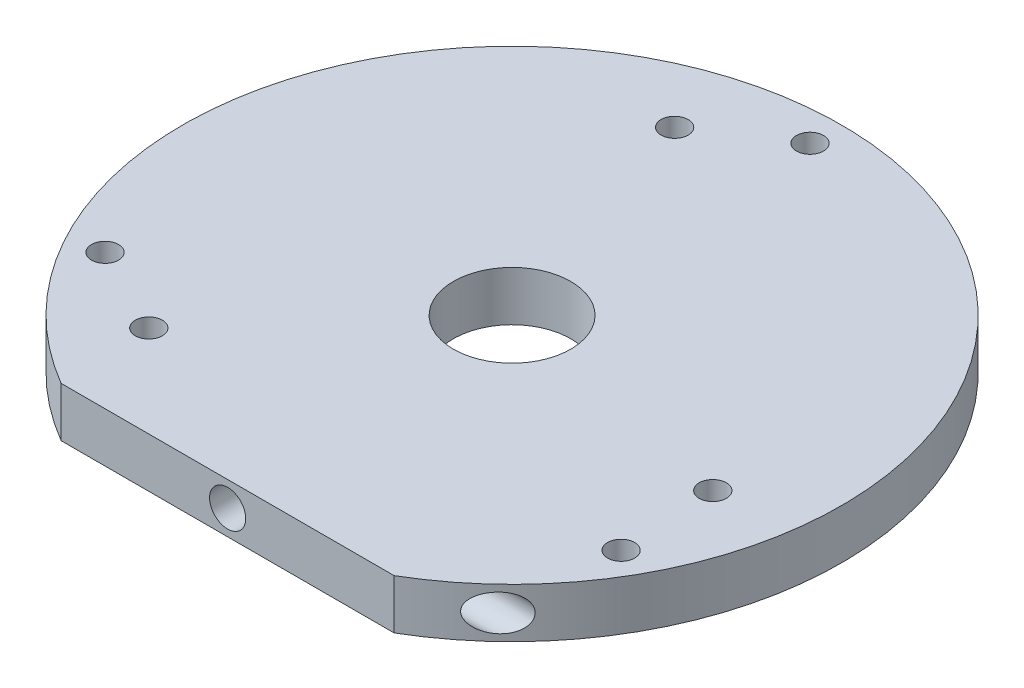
ISO-10303-21;
HEADER;
FILE_DESCRIPTION(('STEP AP214'),'2;1');
FILE_NAME('part.step','',(''),(''),'','','');
FILE_SCHEMA(('AUTOMOTIVE_DESIGN { 1 0 10303 214 1 1 1 1 }'));
ENDSEC;
DATA;
#1=APPLICATION_CONTEXT('core data for automotive mechanical design processes');
#2=APPLICATION_PROTOCOL_DEFINITION('international standard','automotive_design',2000,#1);
#3=PRODUCT_CONTEXT('',#1,'mechanical');
#4=PRODUCT('Part','Part','',(#3));
#5=PRODUCT_RELATED_PRODUCT_CATEGORY('part','',(#4));
#6=PRODUCT_DEFINITION_FORMATION('','',#4);
#7=PRODUCT_DEFINITION_CONTEXT('part definition',#1,'design');
#8=PRODUCT_DEFINITION('design','',#6,#7);
#9=PRODUCT_DEFINITION_SHAPE('','',#8);
#10=(LENGTH_UNIT() NAMED_UNIT(*) SI_UNIT(.MILLI.,.METRE.));
#11=(NAMED_UNIT(*) PLANE_ANGLE_UNIT() SI_UNIT($,.RADIAN.));
#12=(NAMED_UNIT(*) SI_UNIT($,.STERADIAN.) SOLID_ANGLE_UNIT());
#13=UNCERTAINTY_MEASURE_WITH_UNIT(LENGTH_MEASURE(1.E-05),#10,'distance_accuracy_value','');
#14=(GEOMETRIC_REPRESENTATION_CONTEXT(3) GLOBAL_UNCERTAINTY_ASSIGNED_CONTEXT((#13)) GLOBAL_UNIT_ASSIGNED_CONTEXT((#10,
#11,#12)) REPRESENTATION_CONTEXT('',''));
#15=CARTESIAN_POINT('',(0.,0.,0.));
#16=DIRECTION('',(0.,0.,1.));
#17=DIRECTION('',(1.,0.,0.));
#18=AXIS2_PLACEMENT_3D('',#15,#16,#17);
#19=CARTESIAN_POINT('',(36.501,-4.74999999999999,26.5));
#20=DIRECTION('',(-1.,0.,0.));
#21=DIRECTION('',(0.,0.,1.));
#22=AXIS2_PLACEMENT_3D('',#19,#20,#21);
#23=CYLINDRICAL_SURFACE('',#22,2.);
#24=CARTESIAN_POINT('',(22.8035085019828,-4.74999999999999,28.5));
#25=CARTESIAN_POINT('',(22.8035194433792,-4.66614474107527,28.4999917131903));
#26=CARTESIAN_POINT('',(22.8101869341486,-4.58214146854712,28.4946603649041));
#27=CARTESIAN_POINT('',(22.836100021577,-4.41730327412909,28.4738966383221));
#28=CARTESIAN_POINT('',(22.8553814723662,-4.33647808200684,28.4584354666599));
#29=CARTESIAN_POINT('',(22.9042916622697,-4.1812608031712,28.4190848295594));
#30=CARTESIAN_POINT('',(22.9338120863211,-4.10681116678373,28.3952835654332));
#31=CARTESIAN_POINT('',(23.0010219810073,-3.96449597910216,28.3408690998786));
#32=CARTESIAN_POINT('',(23.0387126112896,-3.89663136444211,28.3102549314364));
#33=CARTESIAN_POINT('',(23.1425383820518,-3.73255945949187,28.2255110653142));
#34=CARTESIAN_POINT('',(23.2129906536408,-3.64102699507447,28.1676508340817));
#35=CARTESIAN_POINT('',(23.3634974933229,-3.47316212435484,28.0429420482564));
#36=CARTESIAN_POINT('',(23.443578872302,-3.3968738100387,27.9760683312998));
#37=CARTESIAN_POINT('',(23.5892914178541,-3.27545746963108,27.8532234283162));
#38=CARTESIAN_POINT('',(23.6536059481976,-3.22728716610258,27.798639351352));
#39=CARTESIAN_POINT('',(23.784763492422,-3.13837657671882,27.6865037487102));
#40=CARTESIAN_POINT('',(23.8516077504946,-3.09764000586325,27.6289507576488));
#41=CARTESIAN_POINT('',(24.0548205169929,-2.98595285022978,27.4526435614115));
#42=CARTESIAN_POINT('',(24.1938826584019,-2.92551392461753,27.3302296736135));
#43=CARTESIAN_POINT('',(24.4802446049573,-2.82909849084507,27.0740844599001));
#44=CARTESIAN_POINT('',(24.627655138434,-2.79415684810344,26.9400986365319));
#45=CARTESIAN_POINT('',(24.9223768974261,-2.75228770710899,26.6676836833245));
#46=CARTESIAN_POINT('',(25.0696881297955,-2.74535802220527,26.5292549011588));
#47=CARTESIAN_POINT('',(25.3613275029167,-2.76070477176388,26.2505960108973));
#48=CARTESIAN_POINT('',(25.5056535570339,-2.78300097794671,26.1103647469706));
#49=CARTESIAN_POINT('',(25.7877267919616,-2.85940936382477,25.8318062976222));
#50=CARTESIAN_POINT('',(25.9254811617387,-2.91348587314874,25.6934771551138));
#51=CARTESIAN_POINT('',(26.1515970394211,-3.03641799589,25.462956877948));
#52=CARTESIAN_POINT('',(26.2427926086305,-3.09658550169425,25.3689125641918));
#53=CARTESIAN_POINT('',(26.4167638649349,-3.23641911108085,25.1877003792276));
#54=CARTESIAN_POINT('',(26.4995516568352,-3.31605660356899,25.1005226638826));
#55=CARTESIAN_POINT('',(26.6355340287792,-3.47522142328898,24.9560782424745));
#56=CARTESIAN_POINT('',(26.6911622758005,-3.55059027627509,24.8965356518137));
#57=CARTESIAN_POINT('',(26.7931403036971,-3.71346703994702,24.7867550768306));
#58=CARTESIAN_POINT('',(26.8395013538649,-3.80095998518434,24.7365057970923));
#59=CARTESIAN_POINT('',(26.9134018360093,-3.9708233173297,24.656059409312));
#60=CARTESIAN_POINT('',(26.9428120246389,-4.05144151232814,24.6238951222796));
#61=CARTESIAN_POINT('',(26.9921293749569,-4.21882955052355,24.5698249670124));
#62=CARTESIAN_POINT('',(27.0120416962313,-4.30559602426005,24.5479135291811));
#63=CARTESIAN_POINT('',(27.0412231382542,-4.48350719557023,24.5157651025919));
#64=CARTESIAN_POINT('',(27.0504384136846,-4.57467165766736,24.5055871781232));
#65=CARTESIAN_POINT('',(27.057386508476,-4.75796714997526,24.4979155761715));
#66=CARTESIAN_POINT('',(27.055122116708,-4.85009793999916,24.5004188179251));
#67=CARTESIAN_POINT('',(27.0399634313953,-5.02443145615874,24.5171466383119));
#68=CARTESIAN_POINT('',(27.0279828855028,-5.10681559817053,24.5303636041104));
#69=CARTESIAN_POINT('',(26.9952458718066,-5.26761622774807,24.5663853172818));
#70=CARTESIAN_POINT('',(26.9744886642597,-5.34603238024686,24.5891908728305));
#71=CARTESIAN_POINT('',(26.9241028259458,-5.50074948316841,24.6443529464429));
#72=CARTESIAN_POINT('',(26.8941150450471,-5.57679386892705,24.6770951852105));
#73=CARTESIAN_POINT('',(26.8269802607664,-5.72176054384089,24.7500625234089));
#74=CARTESIAN_POINT('',(26.7898292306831,-5.79067879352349,24.7902918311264));
#75=CARTESIAN_POINT('',(26.6904944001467,-5.95192247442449,24.8972894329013));
#76=CARTESIAN_POINT('',(26.6248128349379,-6.03977326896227,24.9675749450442));
#77=CARTESIAN_POINT('',(26.483957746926,-6.1988282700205,25.116938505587));
#78=CARTESIAN_POINT('',(26.4087637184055,-6.26999553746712,25.1960355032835));
#79=CARTESIAN_POINT('',(26.2230230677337,-6.41932603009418,25.3895022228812));
#80=CARTESIAN_POINT('',(26.1095309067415,-6.49069954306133,25.5062773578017));
#81=CARTESIAN_POINT('',(25.8744931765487,-6.60664263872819,25.7446859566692));
#82=CARTESIAN_POINT('',(25.7529376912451,-6.65117851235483,25.8663253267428));
#83=CARTESIAN_POINT('',(25.4683772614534,-6.72538219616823,26.1469362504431));
#84=CARTESIAN_POINT('',(25.3036716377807,-6.74685849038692,26.3063937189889));
#85=CARTESIAN_POINT('',(25.054260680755,-6.75109382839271,26.5433116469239));
#86=CARTESIAN_POINT('',(24.9706118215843,-6.74781793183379,26.6220157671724));
#87=CARTESIAN_POINT('',(24.8030436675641,-6.73210996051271,26.7782016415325));
#88=CARTESIAN_POINT('',(24.7191245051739,-6.71968184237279,26.8556839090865));
#89=CARTESIAN_POINT('',(24.5506433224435,-6.68556392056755,27.0097965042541));
#90=CARTESIAN_POINT('',(24.4660845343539,-6.66377263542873,27.0864077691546));
#91=CARTESIAN_POINT('',(24.2978650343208,-6.61081415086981,27.2374104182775));
#92=CARTESIAN_POINT('',(24.2142045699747,-6.57964443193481,27.3118012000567));
#93=CARTESIAN_POINT('',(24.0487721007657,-6.50773501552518,27.4575796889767));
#94=CARTESIAN_POINT('',(23.9669959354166,-6.46701918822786,27.5289743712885));
#95=CARTESIAN_POINT('',(23.8061573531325,-6.37551184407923,27.6681797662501));
#96=CARTESIAN_POINT('',(23.7270928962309,-6.32472810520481,27.7359931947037));
#97=CARTESIAN_POINT('',(23.5660096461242,-6.20728499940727,27.8730216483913));
#98=CARTESIAN_POINT('',(23.4843634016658,-6.13960936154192,27.9418154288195));
#99=CARTESIAN_POINT('',(23.3284027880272,-5.99021576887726,28.0721553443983));
#100=CARTESIAN_POINT('',(23.2540791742,-5.90851588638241,28.1337106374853));
#101=CARTESIAN_POINT('',(23.1324306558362,-5.7503510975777,28.2337631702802));
#102=CARTESIAN_POINT('',(23.0828195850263,-5.67696692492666,28.2743134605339));
#103=CARTESIAN_POINT('',(22.9929649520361,-5.52096081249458,28.3474321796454));
#104=CARTESIAN_POINT('',(22.9527095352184,-5.43835076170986,28.3800107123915));
#105=CARTESIAN_POINT('',(22.8923772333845,-5.28403428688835,28.4286867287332));
#106=CARTESIAN_POINT('',(22.8698066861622,-5.21395637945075,28.4468356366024));
#107=CARTESIAN_POINT('',(22.8340060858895,-5.07003923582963,28.4755808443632));
#108=CARTESIAN_POINT('',(22.8207512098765,-4.99621056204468,28.4861972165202));
#109=CARTESIAN_POINT('',(22.8096595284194,-4.89312844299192,28.4950775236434));
#110=CARTESIAN_POINT('',(22.807358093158,-4.86459020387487,28.4969195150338));
#111=CARTESIAN_POINT('',(22.8042805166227,-4.80737377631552,28.4993823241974));
#112=CARTESIAN_POINT('',(22.8035047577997,-4.77869555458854,28.5000028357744));
#113=CARTESIAN_POINT('',(22.8035085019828,-4.74999999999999,28.5));
#114=B_SPLINE_CURVE_WITH_KNOTS('',3,(#24,#25,#26,#27,#28,#29,#30,#31,#32,#33,#34,#35,#36,#37,
#38,#39,#40,#41,#42,#43,#44,#45,#46,#47,#48,#49,#50,#51,#52,#53,#54,#55,#56,#57,#58,#59,#60,#61,
#62,#63,#64,#65,#66,#67,#68,#69,#70,#71,#72,#73,#74,#75,#76,#77,#78,#79,#80,#81,#82,#83,#84,#85,
#86,#87,#88,#89,#90,#91,#92,#93,#94,#95,#96,#97,#98,#99,#100,#101,#102,#103,#104,#105,#106,#107,
#108,#109,#110,#111,#112,#113),.UNSPECIFIED.,.T.,.F.,(4,2,2,2,2,2,2,2,2,2,2,2,2,2,2,2,2,2,2,2,2,
2,2,2,2,2,2,2,2,2,2,2,2,2,2,2,2,2,2,2,2,2,2,2,4),(0.,0.251419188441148,0.503556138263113,
0.753103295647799,1.0026858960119,1.3880944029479,1.77460201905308,2.06563988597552,
2.35682280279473,2.93912672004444,3.54391885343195,4.14866377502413,4.75381802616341,
5.35829434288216,5.78938786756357,6.21985166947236,6.55165131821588,6.88304499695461,
7.15684714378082,7.43050038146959,7.7055252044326,7.98048321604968,8.23222343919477,
8.48398488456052,8.74714645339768,9.01045638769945,9.39910954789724,9.78861526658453,
10.3190888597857,10.850227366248,11.537142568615,11.881574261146,12.2258571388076,
12.573969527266,12.922175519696,13.2695199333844,13.6165970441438,13.9948499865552,
14.3726191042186,14.6639364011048,14.9548825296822,15.1814902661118,15.4074918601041,
15.4935068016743,15.5795433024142),.UNSPECIFIED.);
#115=CARTESIAN_POINT('',(22.8035085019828,-4.74999999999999,28.5));
#116=VERTEX_POINT('',#115);
#117=EDGE_CURVE('E103',#116,#116,#114,.T.);
#118=ORIENTED_EDGE('',*,*,#117,.F.);
#119=EDGE_LOOP('',(#118));
#120=FACE_BOUND('',#119,.T.);
#121=CARTESIAN_POINT('',(0.000911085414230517,-4.75,26.5));
#122=DIRECTION('',(-0.707106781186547,0.,-0.707106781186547));
#123=DIRECTION('',(-0.707106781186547,0.,0.707106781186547));
#124=AXIS2_PLACEMENT_3D('',#121,#122,#123);
#125=ELLIPSE('',#124,2.82842712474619,2.);
#126=CARTESIAN_POINT('',(0.000911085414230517,-2.75,26.5));
#127=VERTEX_POINT('',#126);
#128=CARTESIAN_POINT('',(0.000911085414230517,-6.75,26.5));
#129=VERTEX_POINT('',#128);
#130=EDGE_CURVE('E96',#127,#129,#125,.T.);
#131=ORIENTED_EDGE('',*,*,#130,.T.);
#132=CARTESIAN_POINT('',(0.000911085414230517,-4.75,26.5));
#133=DIRECTION('',(-0.707106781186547,0.,0.707106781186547));
#134=DIRECTION('',(-0.707106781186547,0.,-0.707106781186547));
#135=AXIS2_PLACEMENT_3D('',#132,#133,#134);
#136=ELLIPSE('',#135,2.82842712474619,2.);
#137=EDGE_CURVE('E94',#129,#127,#136,.T.);
#138=ORIENTED_EDGE('',*,*,#137,.T.);
#139=EDGE_LOOP('',(#131,#138));
#140=FACE_BOUND('',#139,.T.);
#141=ADVANCED_FACE('F43',(#120,#140),#23,.F.);
#142=CARTESIAN_POINT('',(0.,37.9568335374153,0.));
#143=DIRECTION('',(0.,1.,0.));
#144=DIRECTION('',(0.,0.,1.));
#145=AXIS2_PLACEMENT_3D('',#142,#143,#144);
#146=CYLINDRICAL_SURFACE('',#145,36.5);
#147=CARTESIAN_POINT('',(0.,-1.99999999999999,0.));
#148=DIRECTION('',(0.,1.,0.));
#149=DIRECTION('',(0.,0.,1.));
#150=AXIS2_PLACEMENT_3D('',#147,#148,#149);
#151=CIRCLE('',#150,36.5);
#152=CARTESIAN_POINT('',(18.4390889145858,-1.99999999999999,31.5));
#153=VERTEX_POINT('',#152);
#154=CARTESIAN_POINT('',(-18.4390889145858,-1.99999999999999,31.5));
#155=VERTEX_POINT('',#154);
#156=EDGE_CURVE('E319',#153,#155,#151,.T.);
#157=ORIENTED_EDGE('',*,*,#156,.F.);
#158=DIRECTION('',(0.,1.,0.));
#159=VECTOR('',#158,1.);
#160=CARTESIAN_POINT('',(18.4390889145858,37.9568335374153,31.5));
#161=LINE('',#160,#159);
#162=CARTESIAN_POINT('',(18.4390889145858,-7.5,31.5));
#163=VERTEX_POINT('',#162);
#164=EDGE_CURVE('E11',#153,#163,#161,.F.);
#165=ORIENTED_EDGE('',*,*,#164,.T.);
#166=CARTESIAN_POINT('',(0.,-7.5,0.));
#167=DIRECTION('',(0.,1.,0.));
#168=DIRECTION('',(0.,0.,1.));
#169=AXIS2_PLACEMENT_3D('',#166,#167,#168);
#170=CIRCLE('',#169,36.5);
#171=CARTESIAN_POINT('',(-18.4390889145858,-7.5,31.5));
#172=VERTEX_POINT('',#171);
#173=EDGE_CURVE('E313',#163,#172,#170,.T.);
#174=ORIENTED_EDGE('',*,*,#173,.T.);
#175=DIRECTION('',(0.,1.,0.));
#176=VECTOR('',#175,1.);
#177=CARTESIAN_POINT('',(-18.4390889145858,37.9568335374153,31.5));
#178=LINE('',#177,#176);
#179=EDGE_CURVE('E52',#172,#155,#178,.T.);
#180=ORIENTED_EDGE('',*,*,#179,.T.);
#181=EDGE_LOOP('',(#157,#165,#174,#180));
#182=FACE_BOUND('',#181,.T.);
#183=ORIENTED_EDGE('',*,*,#117,.T.);
#184=EDGE_LOOP('',(#183));
#185=FACE_BOUND('',#184,.T.);
#186=ADVANCED_FACE('F150',(#182,#185),#146,.T.);
#187=CARTESIAN_POINT('',(36.5,-2.,0.));
#188=DIRECTION('',(0.,-1.,0.));
#189=DIRECTION('',(0.,0.,-1.));
#190=AXIS2_PLACEMENT_3D('',#187,#188,#189);
#191=PLANE('',#190);
#192=CARTESIAN_POINT('',(-18.8964289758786,-2.,21.3348300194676));
#193=DIRECTION('',(0.,1.,0.));
#194=DIRECTION('',(0.,0.,1.));
#195=AXIS2_PLACEMENT_3D('',#192,#193,#194);
#196=CIRCLE('',#195,1.5);
#197=CARTESIAN_POINT('',(-18.8964289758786,-2.,22.8348300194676));
#198=VERTEX_POINT('',#197);
#199=EDGE_CURVE('E387',#198,#198,#196,.T.);
#200=ORIENTED_EDGE('',*,*,#199,.F.);
#201=EDGE_LOOP('',(#200));
#202=FACE_BOUND('',#201,.T.);
#203=CARTESIAN_POINT('',(-9.02829029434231,-2.,-27.0322025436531));
#204=DIRECTION('',(0.,1.,0.));
#205=DIRECTION('',(0.,0.,1.));
#206=AXIS2_PLACEMENT_3D('',#203,#204,#205);
#207=CIRCLE('',#206,1.5);
#208=CARTESIAN_POINT('',(-9.02829029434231,-2.,-25.5322025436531));
#209=VERTEX_POINT('',#208);
#210=EDGE_CURVE('E406',#209,#209,#207,.T.);
#211=ORIENTED_EDGE('',*,*,#210,.F.);
#212=EDGE_LOOP('',(#211));
#213=FACE_BOUND('',#212,.T.);
#214=CARTESIAN_POINT('',(27.924719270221,-2.,5.69737252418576));
#215=DIRECTION('',(0.,1.,0.));
#216=DIRECTION('',(0.,0.,1.));
#217=AXIS2_PLACEMENT_3D('',#214,#215,#216);
#218=CIRCLE('',#217,1.5);
#219=CARTESIAN_POINT('',(27.924719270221,-2.,7.19737252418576));
#220=VERTEX_POINT('',#219);
#221=EDGE_CURVE('E398',#220,#220,#218,.T.);
#222=ORIENTED_EDGE('',*,*,#221,.F.);
#223=EDGE_LOOP('',(#222));
#224=FACE_BOUND('',#223,.T.);
#225=CARTESIAN_POINT('',(0.,-2.,-33.));
#226=DIRECTION('',(0.,-1.,0.));
#227=DIRECTION('',(0.,0.,-1.));
#228=AXIS2_PLACEMENT_3D('',#225,#226,#227);
#229=CIRCLE('',#228,1.5);
#230=CARTESIAN_POINT('',(0.,-2.,-34.5));
#231=VERTEX_POINT('',#230);
#232=EDGE_CURVE('E331',#231,#231,#229,.T.);
#233=ORIENTED_EDGE('',*,*,#232,.T.);
#234=EDGE_LOOP('',(#233));
#235=FACE_BOUND('',#234,.T.);
#236=CARTESIAN_POINT('',(28.578838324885,-2.,16.5000000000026));
#237=DIRECTION('',(0.,-1.,0.));
#238=DIRECTION('',(0.,0.,-1.));
#239=AXIS2_PLACEMENT_3D('',#236,#237,#238);
#240=CIRCLE('',#239,1.49999999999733);
#241=CARTESIAN_POINT('',(28.578838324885,-2.,15.0000000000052));
#242=VERTEX_POINT('',#241);
#243=EDGE_CURVE('E335',#242,#242,#240,.T.);
#244=ORIENTED_EDGE('',*,*,#243,.T.);
#245=EDGE_LOOP('',(#244));
#246=FACE_BOUND('',#245,.T.);
#247=CARTESIAN_POINT('',(-28.5788383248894,-2.,16.4999999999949));
#248=DIRECTION('',(0.,-1.,0.));
#249=DIRECTION('',(0.,0.,-1.));
#250=AXIS2_PLACEMENT_3D('',#247,#248,#249);
#251=CIRCLE('',#250,1.49999999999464);
#252=CARTESIAN_POINT('',(-28.5788383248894,-2.,15.0000000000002));
#253=VERTEX_POINT('',#252);
#254=EDGE_CURVE('E339',#253,#253,#251,.T.);
#255=ORIENTED_EDGE('',*,*,#254,.T.);
#256=EDGE_LOOP('',(#255));
#257=FACE_BOUND('',#256,.T.);
#258=CARTESIAN_POINT('',(0.,-1.99999999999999,0.));
#259=DIRECTION('',(0.,1.,0.));
#260=DIRECTION('',(0.,0.,1.));
#261=AXIS2_PLACEMENT_3D('',#258,#259,#260);
#262=CIRCLE('',#261,6.50000000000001);
#263=CARTESIAN_POINT('',(0.,-1.99999999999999,6.50000000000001));
#264=VERTEX_POINT('',#263);
#265=EDGE_CURVE('E306',#264,#264,#262,.T.);
#266=ORIENTED_EDGE('',*,*,#265,.F.);
#267=EDGE_LOOP('',(#266));
#268=FACE_BOUND('',#267,.T.);
#269=ORIENTED_EDGE('',*,*,#156,.T.);
#270=DIRECTION('',(1.,0.,0.));
#271=VECTOR('',#270,1.);
#272=CARTESIAN_POINT('',(36.5,-2.,31.5));
#273=LINE('',#272,#271);
#274=EDGE_CURVE('E323',#155,#153,#273,.T.);
#275=ORIENTED_EDGE('',*,*,#274,.T.);
#276=EDGE_LOOP('',(#269,#275));
#277=FACE_BOUND('',#276,.T.);
#278=ADVANCED_FACE('F45',(#202,#213,#224,#235,#246,#257,#268,#277),#191,.F.);
#279=CARTESIAN_POINT('',(0.,37.9568335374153,0.));
#280=DIRECTION('',(0.,1.,0.));
#281=DIRECTION('',(0.,0.,1.));
#282=AXIS2_PLACEMENT_3D('',#279,#280,#281);
#283=CYLINDRICAL_SURFACE('',#282,6.50000000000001);
#284=CARTESIAN_POINT('',(0.,-7.5,0.));
#285=DIRECTION('',(0.,1.,0.));
#286=DIRECTION('',(0.,0.,1.));
#287=AXIS2_PLACEMENT_3D('',#284,#285,#286);
#288=CIRCLE('',#287,6.50000000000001);
#289=CARTESIAN_POINT('',(0.,-7.5,6.50000000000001));
#290=VERTEX_POINT('',#289);
#291=EDGE_CURVE('E303',#290,#290,#288,.T.);
#292=ORIENTED_EDGE('',*,*,#291,.F.);
#293=EDGE_LOOP('',(#292));
#294=FACE_BOUND('',#293,.T.);
#295=ORIENTED_EDGE('',*,*,#265,.T.);
#296=EDGE_LOOP('',(#295));
#297=FACE_BOUND('',#296,.T.);
#298=ADVANCED_FACE('F201',(#294,#297),#283,.F.);
#299=CARTESIAN_POINT('',(36.5,-7.5,0.));
#300=DIRECTION('',(0.,1.,0.));
#301=DIRECTION('',(0.,0.,1.));
#302=AXIS2_PLACEMENT_3D('',#299,#300,#301);
#303=PLANE('',#302);
#304=CARTESIAN_POINT('',(-18.8964289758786,-7.5,21.3348300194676));
#305=DIRECTION('',(0.,1.,0.));
#306=DIRECTION('',(0.,0.,1.));
#307=AXIS2_PLACEMENT_3D('',#304,#305,#306);
#308=CIRCLE('',#307,1.5);
#309=CARTESIAN_POINT('',(-18.8964289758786,-7.5,22.8348300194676));
#310=VERTEX_POINT('',#309);
#311=EDGE_CURVE('E380',#310,#310,#308,.T.);
#312=ORIENTED_EDGE('',*,*,#311,.T.);
#313=EDGE_LOOP('',(#312));
#314=FACE_BOUND('',#313,.T.);
#315=CARTESIAN_POINT('',(-9.02829029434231,-7.5,-27.0322025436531));
#316=DIRECTION('',(0.,1.,0.));
#317=DIRECTION('',(0.,0.,1.));
#318=AXIS2_PLACEMENT_3D('',#315,#316,#317);
#319=CIRCLE('',#318,1.5);
#320=CARTESIAN_POINT('',(-9.02829029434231,-7.5,-25.5322025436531));
#321=VERTEX_POINT('',#320);
#322=EDGE_CURVE('E410',#321,#321,#319,.T.);
#323=ORIENTED_EDGE('',*,*,#322,.T.);
#324=EDGE_LOOP('',(#323));
#325=FACE_BOUND('',#324,.T.);
#326=CARTESIAN_POINT('',(27.924719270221,-7.5,5.69737252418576));
#327=DIRECTION('',(0.,1.,0.));
#328=DIRECTION('',(0.,0.,1.));
#329=AXIS2_PLACEMENT_3D('',#326,#327,#328);
#330=CIRCLE('',#329,1.5);
#331=CARTESIAN_POINT('',(27.924719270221,-7.5,7.19737252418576));
#332=VERTEX_POINT('',#331);
#333=EDGE_CURVE('E402',#332,#332,#330,.T.);
#334=ORIENTED_EDGE('',*,*,#333,.T.);
#335=EDGE_LOOP('',(#334));
#336=FACE_BOUND('',#335,.T.);
#337=CARTESIAN_POINT('',(0.,-7.5,-33.));
#338=DIRECTION('',(0.,1.,0.));
#339=DIRECTION('',(0.,0.,1.));
#340=AXIS2_PLACEMENT_3D('',#337,#338,#339);
#341=CIRCLE('',#340,1.5);
#342=CARTESIAN_POINT('',(0.,-7.5,-31.5));
#343=VERTEX_POINT('',#342);
#344=EDGE_CURVE('E119',#343,#343,#341,.T.);
#345=ORIENTED_EDGE('',*,*,#344,.T.);
#346=EDGE_LOOP('',(#345));
#347=FACE_BOUND('',#346,.T.);
#348=CARTESIAN_POINT('',(28.578838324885,-7.5,16.5000000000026));
#349=DIRECTION('',(0.,1.,0.));
#350=DIRECTION('',(0.,0.,1.));
#351=AXIS2_PLACEMENT_3D('',#348,#349,#350);
#352=CIRCLE('',#351,1.49999999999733);
#353=CARTESIAN_POINT('',(28.578838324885,-7.5,17.9999999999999));
#354=VERTEX_POINT('',#353);
#355=EDGE_CURVE('E345',#354,#354,#352,.T.);
#356=ORIENTED_EDGE('',*,*,#355,.T.);
#357=EDGE_LOOP('',(#356));
#358=FACE_BOUND('',#357,.T.);
#359=CARTESIAN_POINT('',(-28.5788383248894,-7.5,16.4999999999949));
#360=DIRECTION('',(0.,1.,0.));
#361=DIRECTION('',(0.,0.,1.));
#362=AXIS2_PLACEMENT_3D('',#359,#360,#361);
#363=CIRCLE('',#362,1.49999999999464);
#364=CARTESIAN_POINT('',(-28.5788383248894,-7.5,17.9999999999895));
#365=VERTEX_POINT('',#364);
#366=EDGE_CURVE('E107',#365,#365,#363,.T.);
#367=ORIENTED_EDGE('',*,*,#366,.T.);
#368=EDGE_LOOP('',(#367));
#369=FACE_BOUND('',#368,.T.);
#370=ORIENTED_EDGE('',*,*,#173,.F.);
#371=DIRECTION('',(-1.,0.,0.));
#372=VECTOR('',#371,1.);
#373=CARTESIAN_POINT('',(36.5,-7.5,31.5));
#374=LINE('',#373,#372);
#375=EDGE_CURVE('E327',#163,#172,#374,.T.);
#376=ORIENTED_EDGE('',*,*,#375,.T.);
#377=EDGE_LOOP('',(#370,#376));
#378=FACE_BOUND('',#377,.T.);
#379=ORIENTED_EDGE('',*,*,#291,.T.);
#380=EDGE_LOOP('',(#379));
#381=FACE_BOUND('',#380,.T.);
#382=ADVANCED_FACE('F215',(#314,#325,#336,#347,#358,#369,#378,#381),#303,.F.);
#383=CARTESIAN_POINT('',(-18.4390889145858,-8.,31.5));
#384=DIRECTION('',(0.,0.,-1.));
#385=DIRECTION('',(-1.,0.,0.));
#386=AXIS2_PLACEMENT_3D('',#383,#384,#385);
#387=PLANE('',#386);
#388=CARTESIAN_POINT('',(0.000911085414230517,-4.75,31.5));
#389=DIRECTION('',(0.,0.,-1.));
#390=DIRECTION('',(-1.,0.,0.));
#391=AXIS2_PLACEMENT_3D('',#388,#389,#390);
#392=CIRCLE('',#391,2.);
#393=CARTESIAN_POINT('',(-1.99908891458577,-4.75,31.5));
#394=VERTEX_POINT('',#393);
#395=EDGE_CURVE('E377',#394,#394,#392,.T.);
#396=ORIENTED_EDGE('',*,*,#395,.T.);
#397=EDGE_LOOP('',(#396));
#398=FACE_BOUND('',#397,.T.);
#399=ORIENTED_EDGE('',*,*,#179,.F.);
#400=ORIENTED_EDGE('',*,*,#375,.F.);
#401=ORIENTED_EDGE('',*,*,#164,.F.);
#402=ORIENTED_EDGE('',*,*,#274,.F.);
#403=EDGE_LOOP('',(#399,#400,#401,#402));
#404=FACE_BOUND('',#403,.T.);
#405=ADVANCED_FACE('F224',(#398,#404),#387,.F.);
#406=CARTESIAN_POINT('',(-28.5788383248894,-7.5,16.4999999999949));
#407=DIRECTION('',(0.,1.,0.));
#408=DIRECTION('',(0.,0.,1.));
#409=AXIS2_PLACEMENT_3D('',#406,#407,#408);
#410=CYLINDRICAL_SURFACE('',#409,1.49999999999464);
#411=ORIENTED_EDGE('',*,*,#366,.F.);
#412=EDGE_LOOP('',(#411));
#413=FACE_BOUND('',#412,.T.);
#414=ORIENTED_EDGE('',*,*,#254,.F.);
#415=EDGE_LOOP('',(#414));
#416=FACE_BOUND('',#415,.T.);
#417=ADVANCED_FACE('F238',(#413,#416),#410,.F.);
#418=CARTESIAN_POINT('',(28.578838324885,-7.5,16.5000000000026));
#419=DIRECTION('',(0.,1.,0.));
#420=DIRECTION('',(0.,0.,1.));
#421=AXIS2_PLACEMENT_3D('',#418,#419,#420);
#422=CYLINDRICAL_SURFACE('',#421,1.49999999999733);
#423=ORIENTED_EDGE('',*,*,#355,.F.);
#424=EDGE_LOOP('',(#423));
#425=FACE_BOUND('',#424,.T.);
#426=ORIENTED_EDGE('',*,*,#243,.F.);
#427=EDGE_LOOP('',(#426));
#428=FACE_BOUND('',#427,.T.);
#429=ADVANCED_FACE('F246',(#425,#428),#422,.F.);
#430=CARTESIAN_POINT('',(0.,-7.5,-33.));
#431=DIRECTION('',(0.,1.,0.));
#432=DIRECTION('',(0.,0.,1.));
#433=AXIS2_PLACEMENT_3D('',#430,#431,#432);
#434=CYLINDRICAL_SURFACE('',#433,1.5);
#435=ORIENTED_EDGE('',*,*,#344,.F.);
#436=EDGE_LOOP('',(#435));
#437=FACE_BOUND('',#436,.T.);
#438=ORIENTED_EDGE('',*,*,#232,.F.);
#439=EDGE_LOOP('',(#438));
#440=FACE_BOUND('',#439,.T.);
#441=ADVANCED_FACE('F129',(#437,#440),#434,.F.);
#442=CARTESIAN_POINT('',(0.000911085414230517,-4.75,21.5));
#443=DIRECTION('',(0.,0.,1.));
#444=DIRECTION('',(1.,0.,0.));
#445=AXIS2_PLACEMENT_3D('',#442,#443,#444);
#446=CYLINDRICAL_SURFACE('',#445,2.);
#447=CARTESIAN_POINT('',(0.000911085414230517,-4.75,21.5));
#448=DIRECTION('',(0.,0.,-1.));
#449=DIRECTION('',(-1.,0.,0.));
#450=AXIS2_PLACEMENT_3D('',#447,#448,#449);
#451=CIRCLE('',#450,2.);
#452=CARTESIAN_POINT('',(-1.99908891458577,-4.75,21.5));
#453=VERTEX_POINT('',#452);
#454=EDGE_CURVE('E97',#453,#453,#451,.T.);
#455=ORIENTED_EDGE('',*,*,#454,.T.);
#456=EDGE_LOOP('',(#455));
#457=FACE_BOUND('',#456,.T.);
#458=ORIENTED_EDGE('',*,*,#395,.F.);
#459=EDGE_LOOP('',(#458));
#460=FACE_BOUND('',#459,.T.);
#461=CARTESIAN_POINT('',(0.,-4.74999999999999,26.5));
#462=DIRECTION('',(1.,0.,0.));
#463=DIRECTION('',(0.,0.,-1.));
#464=AXIS2_PLACEMENT_3D('',#461,#462,#463);
#465=CIRCLE('',#464,2.);
#466=CARTESIAN_POINT('',(0.,-6.74999979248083,26.5009110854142));
#467=VERTEX_POINT('',#466);
#468=CARTESIAN_POINT('',(0.,-6.74999979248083,26.4990889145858));
#469=VERTEX_POINT('',#468);
#470=EDGE_CURVE('E92',#467,#469,#465,.T.);
#471=ORIENTED_EDGE('',*,*,#470,.T.);
#472=CARTESIAN_POINT('',(0.000911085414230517,-4.75,26.5));
#473=DIRECTION('',(-0.707106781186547,0.,0.707106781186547));
#474=DIRECTION('',(-0.707106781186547,0.,-0.707106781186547));
#475=AXIS2_PLACEMENT_3D('',#472,#473,#474);
#476=ELLIPSE('',#475,2.82842712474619,2.);
#477=EDGE_CURVE('E101',#129,#469,#476,.F.);
#478=ORIENTED_EDGE('',*,*,#477,.F.);
#479=ORIENTED_EDGE('',*,*,#130,.F.);
#480=CARTESIAN_POINT('',(0.,-2.75000020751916,26.4990889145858));
#481=VERTEX_POINT('',#480);
#482=EDGE_CURVE('E109',#481,#127,#476,.F.);
#483=ORIENTED_EDGE('',*,*,#482,.F.);
#484=CARTESIAN_POINT('',(0.,-2.75000020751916,26.5009110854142));
#485=VERTEX_POINT('',#484);
#486=EDGE_CURVE('E67',#481,#485,#465,.T.);
#487=ORIENTED_EDGE('',*,*,#486,.T.);
#488=CARTESIAN_POINT('',(0.000911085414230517,-4.75,26.5));
#489=DIRECTION('',(-0.707106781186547,0.,-0.707106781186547));
#490=DIRECTION('',(-0.707106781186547,0.,0.707106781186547));
#491=AXIS2_PLACEMENT_3D('',#488,#489,#490);
#492=ELLIPSE('',#491,2.82842712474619,2.);
#493=EDGE_CURVE('E99',#127,#485,#492,.F.);
#494=ORIENTED_EDGE('',*,*,#493,.F.);
#495=ORIENTED_EDGE('',*,*,#137,.F.);
#496=EDGE_CURVE('E59',#467,#129,#492,.F.);
#497=ORIENTED_EDGE('',*,*,#496,.F.);
#498=EDGE_LOOP('',(#471,#478,#479,#483,#487,#494,#495,#497));
#499=FACE_BOUND('',#498,.T.);
#500=ADVANCED_FACE('F90',(#457,#460,#499),#446,.F.);
#501=CARTESIAN_POINT('',(0.000911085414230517,-4.75,21.5));
#502=DIRECTION('',(0.,0.,-1.));
#503=DIRECTION('',(-1.,0.,0.));
#504=AXIS2_PLACEMENT_3D('',#501,#502,#503);
#505=PLANE('',#504);
#506=ORIENTED_EDGE('',*,*,#454,.F.);
#507=EDGE_LOOP('',(#506));
#508=FACE_BOUND('',#507,.T.);
#509=ADVANCED_FACE('F128',(#508),#505,.F.);
#510=ORIENTED_EDGE('',*,*,#486,.F.);
#511=ORIENTED_EDGE('',*,*,#482,.T.);
#512=ORIENTED_EDGE('',*,*,#493,.T.);
#513=EDGE_LOOP('',(#510,#511,#512));
#514=FACE_BOUND('',#513,.T.);
#515=ADVANCED_FACE('F121',(#514),#23,.F.);
#516=ORIENTED_EDGE('',*,*,#496,.T.);
#517=ORIENTED_EDGE('',*,*,#477,.T.);
#518=ORIENTED_EDGE('',*,*,#470,.F.);
#519=EDGE_LOOP('',(#516,#517,#518));
#520=FACE_BOUND('',#519,.T.);
#521=ADVANCED_FACE('F100',(#520),#23,.F.);
#522=CARTESIAN_POINT('',(27.924719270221,-7.5,5.69737252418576));
#523=DIRECTION('',(0.,1.,0.));
#524=DIRECTION('',(0.,0.,1.));
#525=AXIS2_PLACEMENT_3D('',#522,#523,#524);
#526=CYLINDRICAL_SURFACE('',#525,1.5);
#527=ORIENTED_EDGE('',*,*,#333,.F.);
#528=EDGE_LOOP('',(#527));
#529=FACE_BOUND('',#528,.T.);
#530=ORIENTED_EDGE('',*,*,#221,.T.);
#531=EDGE_LOOP('',(#530));
#532=FACE_BOUND('',#531,.T.);
#533=ADVANCED_FACE('F134',(#529,#532),#526,.F.);
#534=CARTESIAN_POINT('',(-9.02829029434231,-7.5,-27.0322025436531));
#535=DIRECTION('',(0.,1.,0.));
#536=DIRECTION('',(0.,0.,1.));
#537=AXIS2_PLACEMENT_3D('',#534,#535,#536);
#538=CYLINDRICAL_SURFACE('',#537,1.5);
#539=ORIENTED_EDGE('',*,*,#322,.F.);
#540=EDGE_LOOP('',(#539));
#541=FACE_BOUND('',#540,.T.);
#542=ORIENTED_EDGE('',*,*,#210,.T.);
#543=EDGE_LOOP('',(#542));
#544=FACE_BOUND('',#543,.T.);
#545=ADVANCED_FACE('F137',(#541,#544),#538,.F.);
#546=CARTESIAN_POINT('',(-18.8964289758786,-7.5,21.3348300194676));
#547=DIRECTION('',(0.,1.,0.));
#548=DIRECTION('',(0.,0.,1.));
#549=AXIS2_PLACEMENT_3D('',#546,#547,#548);
#550=CYLINDRICAL_SURFACE('',#549,1.5);
#551=ORIENTED_EDGE('',*,*,#311,.F.);
#552=EDGE_LOOP('',(#551));
#553=FACE_BOUND('',#552,.T.);
#554=ORIENTED_EDGE('',*,*,#199,.T.);
#555=EDGE_LOOP('',(#554));
#556=FACE_BOUND('',#555,.T.);
#557=ADVANCED_FACE('F141',(#553,#556),#550,.F.);
#558=CLOSED_SHELL('',(#141,#186,#278,#298,#382,#405,#417,#429,#441,#500,#509,#515,#521,#533,
#545,#557));
#559=MANIFOLD_SOLID_BREP('B2',#558);
#560=ADVANCED_BREP_SHAPE_REPRESENTATION('',(#18,#559),#14);
#561=SHAPE_DEFINITION_REPRESENTATION(#9,#560);
ENDSEC;
END-ISO-10303-21;
